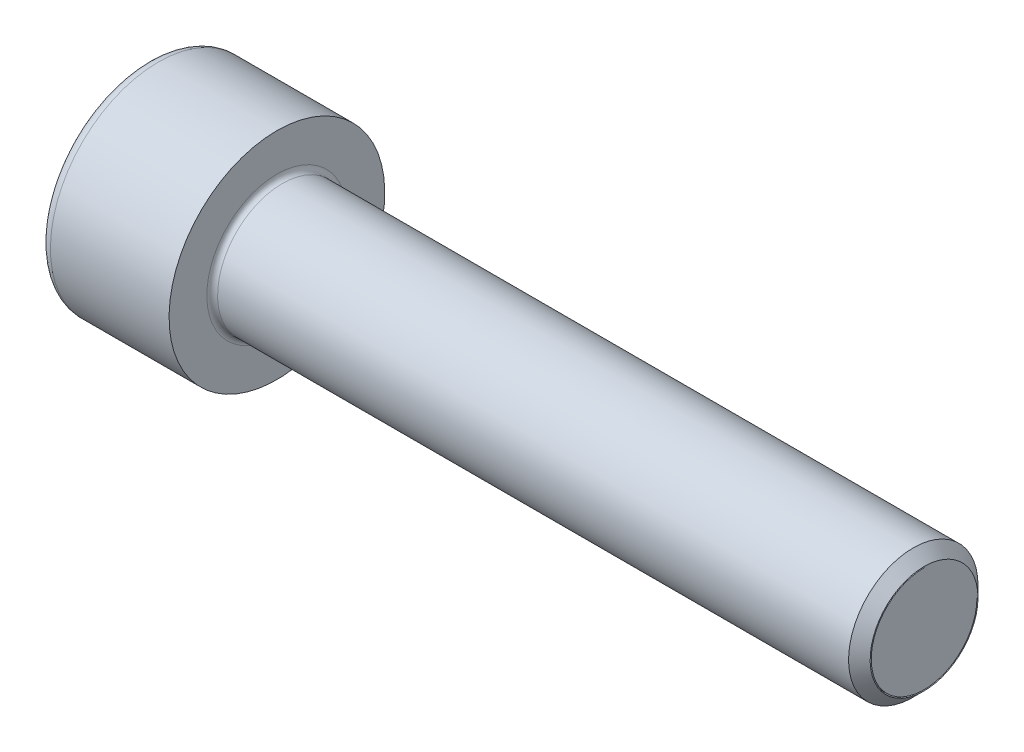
ISO-10303-21;
HEADER;
FILE_DESCRIPTION(('STEP AP214'),'2;1');
FILE_NAME('part.step','',(''),(''),'','','');
FILE_SCHEMA(('AUTOMOTIVE_DESIGN { 1 0 10303 214 1 1 1 1 }'));
ENDSEC;
DATA;
#1=APPLICATION_CONTEXT('core data for automotive mechanical design processes');
#2=APPLICATION_PROTOCOL_DEFINITION('international standard','automotive_design',2000,#1);
#3=PRODUCT_CONTEXT('',#1,'mechanical');
#4=PRODUCT('Part','Part','',(#3));
#5=PRODUCT_RELATED_PRODUCT_CATEGORY('part','',(#4));
#6=PRODUCT_DEFINITION_FORMATION('','',#4);
#7=PRODUCT_DEFINITION_CONTEXT('part definition',#1,'design');
#8=PRODUCT_DEFINITION('design','',#6,#7);
#9=PRODUCT_DEFINITION_SHAPE('','',#8);
#10=(LENGTH_UNIT() NAMED_UNIT(*) SI_UNIT(.MILLI.,.METRE.));
#11=(NAMED_UNIT(*) PLANE_ANGLE_UNIT() SI_UNIT($,.RADIAN.));
#12=(NAMED_UNIT(*) SI_UNIT($,.STERADIAN.) SOLID_ANGLE_UNIT());
#13=UNCERTAINTY_MEASURE_WITH_UNIT(LENGTH_MEASURE(1.E-05),#10,'distance_accuracy_value','');
#14=(GEOMETRIC_REPRESENTATION_CONTEXT(3) GLOBAL_UNCERTAINTY_ASSIGNED_CONTEXT((#13)) GLOBAL_UNIT_ASSIGNED_CONTEXT((#10,
#11,#12)) REPRESENTATION_CONTEXT('',''));
#15=CARTESIAN_POINT('',(0.,0.,0.));
#16=DIRECTION('',(0.,0.,1.));
#17=DIRECTION('',(1.,0.,0.));
#18=AXIS2_PLACEMENT_3D('',#15,#16,#17);
#19=CARTESIAN_POINT('',(3.,1.5,0.));
#20=DIRECTION('',(1.,0.,0.));
#21=DIRECTION('',(0.,0.,-1.));
#22=AXIS2_PLACEMENT_3D('',#19,#20,#21);
#23=PLANE('',#22);
#24=CARTESIAN_POINT('',(3.,0.,0.));
#25=DIRECTION('',(-1.,0.,0.));
#26=DIRECTION('',(0.,1.,0.));
#27=AXIS2_PLACEMENT_3D('',#24,#25,#26);
#28=CIRCLE('',#27,2.45);
#29=CARTESIAN_POINT('',(3.,0.,-2.45000000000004));
#30=VERTEX_POINT('',#29);
#31=CARTESIAN_POINT('',(3.,2.44999999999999,0.));
#32=VERTEX_POINT('',#31);
#33=EDGE_CURVE('E58',#30,#32,#28,.T.);
#34=ORIENTED_EDGE('',*,*,#33,.T.);
#35=DIRECTION('',(0.,1.,0.));
#36=VECTOR('',#35,1.);
#37=CARTESIAN_POINT('',(3.,1.98749999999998,0.));
#38=LINE('',#37,#36);
#39=CARTESIAN_POINT('',(3.,2.49999999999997,0.));
#40=VERTEX_POINT('',#39);
#41=EDGE_CURVE('E303',#32,#40,#38,.T.);
#42=ORIENTED_EDGE('',*,*,#41,.T.);
#43=CARTESIAN_POINT('',(3.,0.,0.));
#44=DIRECTION('',(1.,0.,0.));
#45=DIRECTION('',(0.,1.,0.));
#46=AXIS2_PLACEMENT_3D('',#43,#44,#45);
#47=CIRCLE('',#46,2.5);
#48=CARTESIAN_POINT('',(3.,0.,-2.50000000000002));
#49=VERTEX_POINT('',#48);
#50=EDGE_CURVE('E301',#40,#49,#47,.T.);
#51=ORIENTED_EDGE('',*,*,#50,.T.);
#52=DIRECTION('',(0.,0.,1.));
#53=VECTOR('',#52,1.);
#54=CARTESIAN_POINT('',(3.,0.,-1.23750000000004));
#55=LINE('',#54,#53);
#56=EDGE_CURVE('E168',#49,#30,#55,.T.);
#57=ORIENTED_EDGE('',*,*,#56,.T.);
#58=EDGE_LOOP('',(#34,#42,#51,#57));
#59=FACE_BOUND('',#58,.T.);
#60=ADVANCED_FACE('F40',(#59),#23,.T.);
#61=CARTESIAN_POINT('',(1.62499999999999,0.,0.));
#62=DIRECTION('',(-1.,0.,0.));
#63=DIRECTION('',(0.,0.,1.));
#64=AXIS2_PLACEMENT_3D('',#61,#62,#63);
#65=CYLINDRICAL_SURFACE('',#64,3.);
#66=CARTESIAN_POINT('',(29.5000000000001,0.,0.));
#67=DIRECTION('',(1.,0.,0.));
#68=DIRECTION('',(0.,0.,-1.));
#69=AXIS2_PLACEMENT_3D('',#66,#67,#68);
#70=CIRCLE('',#69,3.);
#71=CARTESIAN_POINT('',(29.5000000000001,0.,-3.00000000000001));
#72=VERTEX_POINT('',#71);
#73=EDGE_CURVE('E11',#72,#72,#70,.F.);
#74=ORIENTED_EDGE('',*,*,#73,.T.);
#75=EDGE_LOOP('',(#74));
#76=FACE_BOUND('',#75,.T.);
#77=CARTESIAN_POINT('',(0.249999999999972,0.,0.));
#78=DIRECTION('',(1.,0.,0.));
#79=DIRECTION('',(0.,1.,0.));
#80=AXIS2_PLACEMENT_3D('',#77,#78,#79);
#81=CIRCLE('',#80,3.);
#82=CARTESIAN_POINT('',(0.249999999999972,3.00000000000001,0.));
#83=VERTEX_POINT('',#82);
#84=EDGE_CURVE('E164',#83,#83,#81,.T.);
#85=ORIENTED_EDGE('',*,*,#84,.T.);
#86=EDGE_LOOP('',(#85));
#87=FACE_BOUND('',#86,.T.);
#88=ADVANCED_FACE('F213',(#76,#87),#65,.T.);
#89=CARTESIAN_POINT('',(0.249999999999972,0.,0.));
#90=DIRECTION('',(1.,0.,0.));
#91=DIRECTION('',(0.,0.,-1.));
#92=AXIS2_PLACEMENT_3D('',#89,#90,#91);
#93=TOROIDAL_SURFACE('',#92,3.25000000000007,0.25);
#94=CARTESIAN_POINT('',(0.,0.,0.));
#95=DIRECTION('',(1.,0.,0.));
#96=DIRECTION('',(0.,1.,0.));
#97=AXIS2_PLACEMENT_3D('',#94,#95,#96);
#98=CIRCLE('',#97,3.25);
#99=CARTESIAN_POINT('',(0.,3.25000000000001,0.));
#100=VERTEX_POINT('',#99);
#101=EDGE_CURVE('E169',#100,#100,#98,.T.);
#102=ORIENTED_EDGE('',*,*,#101,.T.);
#103=EDGE_LOOP('',(#102));
#104=FACE_BOUND('',#103,.T.);
#105=ORIENTED_EDGE('',*,*,#84,.F.);
#106=EDGE_LOOP('',(#105));
#107=FACE_BOUND('',#106,.T.);
#108=ADVANCED_FACE('F208',(#104,#107),#93,.F.);
#109=CARTESIAN_POINT('',(0.,4.12499999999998,0.));
#110=DIRECTION('',(1.,0.,0.));
#111=DIRECTION('',(0.,0.,-1.));
#112=AXIS2_PLACEMENT_3D('',#109,#110,#111);
#113=PLANE('',#112);
#114=CARTESIAN_POINT('',(0.,0.,0.));
#115=DIRECTION('',(1.,0.,0.));
#116=DIRECTION('',(0.,1.,0.));
#117=AXIS2_PLACEMENT_3D('',#114,#115,#116);
#118=CIRCLE('',#117,5.);
#119=CARTESIAN_POINT('',(0.,5.00000000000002,0.));
#120=VERTEX_POINT('',#119);
#121=EDGE_CURVE('E335',#120,#120,#118,.T.);
#122=ORIENTED_EDGE('',*,*,#121,.T.);
#123=EDGE_LOOP('',(#122));
#124=FACE_BOUND('',#123,.T.);
#125=ORIENTED_EDGE('',*,*,#101,.F.);
#126=EDGE_LOOP('',(#125));
#127=FACE_BOUND('',#126,.T.);
#128=ADVANCED_FACE('F212',(#124,#127),#113,.T.);
#129=CARTESIAN_POINT('',(-2.75000000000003,0.,0.));
#130=DIRECTION('',(-1.,0.,0.));
#131=DIRECTION('',(0.,0.,1.));
#132=AXIS2_PLACEMENT_3D('',#129,#130,#131);
#133=CYLINDRICAL_SURFACE('',#132,5.);
#134=CARTESIAN_POINT('',(-5.49999999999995,0.,0.));
#135=DIRECTION('',(1.,0.,0.));
#136=DIRECTION('',(0.,1.,0.));
#137=AXIS2_PLACEMENT_3D('',#134,#135,#136);
#138=CIRCLE('',#137,5.);
#139=CARTESIAN_POINT('',(-5.49999999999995,5.00000000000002,0.));
#140=VERTEX_POINT('',#139);
#141=EDGE_CURVE('E331',#140,#140,#138,.T.);
#142=ORIENTED_EDGE('',*,*,#141,.T.);
#143=EDGE_LOOP('',(#142));
#144=FACE_BOUND('',#143,.T.);
#145=ORIENTED_EDGE('',*,*,#121,.F.);
#146=EDGE_LOOP('',(#145));
#147=FACE_BOUND('',#146,.T.);
#148=ADVANCED_FACE('F218',(#144,#147),#133,.T.);
#149=CARTESIAN_POINT('',(-5.49999999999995,0.,0.));
#150=DIRECTION('',(1.,0.,0.));
#151=DIRECTION('',(0.,0.,-1.));
#152=AXIS2_PLACEMENT_3D('',#149,#150,#151);
#153=TOROIDAL_SURFACE('',#152,4.49999999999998,0.5);
#154=CARTESIAN_POINT('',(-6.00000000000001,0.,0.));
#155=DIRECTION('',(1.,0.,0.));
#156=DIRECTION('',(0.,1.,0.));
#157=AXIS2_PLACEMENT_3D('',#154,#155,#156);
#158=CIRCLE('',#157,4.5);
#159=CARTESIAN_POINT('',(-6.00000000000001,4.50000000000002,0.));
#160=VERTEX_POINT('',#159);
#161=EDGE_CURVE('E159',#160,#160,#158,.T.);
#162=ORIENTED_EDGE('',*,*,#161,.T.);
#163=EDGE_LOOP('',(#162));
#164=FACE_BOUND('',#163,.T.);
#165=ORIENTED_EDGE('',*,*,#141,.F.);
#166=EDGE_LOOP('',(#165));
#167=FACE_BOUND('',#166,.T.);
#168=ADVANCED_FACE('F222',(#164,#167),#153,.T.);
#169=CARTESIAN_POINT('',(-6.00000000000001,2.25,0.));
#170=DIRECTION('',(-1.,0.,0.));
#171=DIRECTION('',(0.,0.,1.));
#172=AXIS2_PLACEMENT_3D('',#169,#170,#171);
#173=PLANE('',#172);
#174=ORIENTED_EDGE('',*,*,#161,.F.);
#175=EDGE_LOOP('',(#174));
#176=FACE_BOUND('',#175,.T.);
#177=DIRECTION('',(0.,-0.500000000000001,-0.866025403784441));
#178=VECTOR('',#177,1.);
#179=CARTESIAN_POINT('',(-6.00000000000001,-1.5229695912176,2.36213928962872));
#180=LINE('',#179,#178);
#181=CARTESIAN_POINT('',(-6.00000000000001,-1.44337567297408,2.5));
#182=VERTEX_POINT('',#181);
#183=CARTESIAN_POINT('',(-6.00000000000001,-2.88675134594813,0.));
#184=VERTEX_POINT('',#183);
#185=EDGE_CURVE('E327',#182,#184,#180,.T.);
#186=ORIENTED_EDGE('',*,*,#185,.T.);
#187=DIRECTION('',(0.,0.500000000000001,-0.866025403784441));
#188=VECTOR('',#187,1.);
#189=CARTESIAN_POINT('',(-6.00000000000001,-2.24465742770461,-1.11213928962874));
#190=LINE('',#189,#188);
#191=CARTESIAN_POINT('',(-6.00000000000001,-1.44337567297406,-2.50000000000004));
#192=VERTEX_POINT('',#191);
#193=EDGE_CURVE('E134',#184,#192,#190,.T.);
#194=ORIENTED_EDGE('',*,*,#193,.T.);
#195=DIRECTION('',(0.,1.,0.));
#196=VECTOR('',#195,1.);
#197=CARTESIAN_POINT('',(-6.00000000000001,0.403312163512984,-2.50000000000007));
#198=LINE('',#197,#196);
#199=CARTESIAN_POINT('',(-6.00000000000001,1.44337567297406,-2.50000000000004));
#200=VERTEX_POINT('',#199);
#201=EDGE_CURVE('E115',#192,#200,#198,.T.);
#202=ORIENTED_EDGE('',*,*,#201,.T.);
#203=DIRECTION('',(0.,0.500000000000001,0.866025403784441));
#204=VECTOR('',#203,1.);
#205=CARTESIAN_POINT('',(-6.00000000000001,2.08546959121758,-1.38786071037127));
#206=LINE('',#205,#204);
#207=CARTESIAN_POINT('',(-6.00000000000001,2.88675134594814,0.));
#208=VERTEX_POINT('',#207);
#209=EDGE_CURVE('E132',#200,#208,#206,.T.);
#210=ORIENTED_EDGE('',*,*,#209,.T.);
#211=DIRECTION('',(0.,-0.500000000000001,0.866025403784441));
#212=VECTOR('',#211,1.);
#213=CARTESIAN_POINT('',(-6.00000000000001,2.80715742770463,0.137860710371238));
#214=LINE('',#213,#212);
#215=CARTESIAN_POINT('',(-6.00000000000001,1.44337567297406,2.49999999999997));
#216=VERTEX_POINT('',#215);
#217=EDGE_CURVE('E142',#208,#216,#214,.T.);
#218=ORIENTED_EDGE('',*,*,#217,.T.);
#219=DIRECTION('',(0.,-1.,0.));
#220=VECTOR('',#219,1.);
#221=CARTESIAN_POINT('',(-6.00000000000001,1.84668783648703,2.49999999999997));
#222=LINE('',#221,#220);
#223=EDGE_CURVE('E147',#216,#182,#222,.T.);
#224=ORIENTED_EDGE('',*,*,#223,.T.);
#225=EDGE_LOOP('',(#186,#194,#202,#210,#218,#224));
#226=FACE_BOUND('',#225,.T.);
#227=ADVANCED_FACE('F130',(#176,#226),#173,.T.);
#228=CARTESIAN_POINT('',(-3.,0.,0.));
#229=DIRECTION('',(-1.,0.,0.));
#230=DIRECTION('',(0.,0.,1.));
#231=AXIS2_PLACEMENT_3D('',#228,#229,#230);
#232=PLANE('',#231);
#233=DIRECTION('',(0.,1.,0.));
#234=VECTOR('',#233,1.);
#235=CARTESIAN_POINT('',(-3.,-1.44337567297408,2.5));
#236=LINE('',#235,#234);
#237=CARTESIAN_POINT('',(-3.,-1.44337567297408,2.5));
#238=VERTEX_POINT('',#237);
#239=CARTESIAN_POINT('',(-3.,1.44337567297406,2.49999999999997));
#240=VERTEX_POINT('',#239);
#241=EDGE_CURVE('E184',#238,#240,#236,.T.);
#242=ORIENTED_EDGE('',*,*,#241,.T.);
#243=DIRECTION('',(0.,0.500000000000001,-0.866025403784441));
#244=VECTOR('',#243,1.);
#245=CARTESIAN_POINT('',(-3.,1.44337567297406,2.49999999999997));
#246=LINE('',#245,#244);
#247=CARTESIAN_POINT('',(-3.,2.88675134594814,0.));
#248=VERTEX_POINT('',#247);
#249=EDGE_CURVE('E188',#240,#248,#246,.T.);
#250=ORIENTED_EDGE('',*,*,#249,.T.);
#251=DIRECTION('',(0.,-0.500000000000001,-0.866025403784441));
#252=VECTOR('',#251,1.);
#253=CARTESIAN_POINT('',(-3.,2.88675134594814,0.));
#254=LINE('',#253,#252);
#255=CARTESIAN_POINT('',(-3.,1.44337567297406,-2.50000000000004));
#256=VERTEX_POINT('',#255);
#257=EDGE_CURVE('E151',#248,#256,#254,.T.);
#258=ORIENTED_EDGE('',*,*,#257,.T.);
#259=DIRECTION('',(0.,-1.,0.));
#260=VECTOR('',#259,1.);
#261=CARTESIAN_POINT('',(-3.,1.44337567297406,-2.50000000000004));
#262=LINE('',#261,#260);
#263=CARTESIAN_POINT('',(-3.,-1.44337567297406,-2.50000000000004));
#264=VERTEX_POINT('',#263);
#265=EDGE_CURVE('E118',#256,#264,#262,.T.);
#266=ORIENTED_EDGE('',*,*,#265,.T.);
#267=DIRECTION('',(0.,-0.500000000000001,0.866025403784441));
#268=VECTOR('',#267,1.);
#269=CARTESIAN_POINT('',(-3.,-1.44337567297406,-2.50000000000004));
#270=LINE('',#269,#268);
#271=CARTESIAN_POINT('',(-3.,-2.88675134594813,0.));
#272=VERTEX_POINT('',#271);
#273=EDGE_CURVE('E192',#264,#272,#270,.T.);
#274=ORIENTED_EDGE('',*,*,#273,.T.);
#275=DIRECTION('',(0.,0.500000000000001,0.866025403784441));
#276=VECTOR('',#275,1.);
#277=CARTESIAN_POINT('',(-3.,-2.88675134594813,0.));
#278=LINE('',#277,#276);
#279=EDGE_CURVE('E124',#272,#238,#278,.T.);
#280=ORIENTED_EDGE('',*,*,#279,.T.);
#281=EDGE_LOOP('',(#242,#250,#258,#266,#274,#280));
#282=FACE_BOUND('',#281,.T.);
#283=ADVANCED_FACE('F229',(#282),#232,.T.);
#284=CARTESIAN_POINT('',(-3.,-1.44337567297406,-2.50000000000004));
#285=DIRECTION('',(0.,0.,1.));
#286=DIRECTION('',(1.,0.,0.));
#287=AXIS2_PLACEMENT_3D('',#284,#285,#286);
#288=PLANE('',#287);
#289=ORIENTED_EDGE('',*,*,#201,.F.);
#290=DIRECTION('',(-1.,0.,0.));
#291=VECTOR('',#290,1.);
#292=CARTESIAN_POINT('',(-3.,-1.44337567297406,-2.50000000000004));
#293=LINE('',#292,#291);
#294=EDGE_CURVE('E125',#264,#192,#293,.T.);
#295=ORIENTED_EDGE('',*,*,#294,.F.);
#296=ORIENTED_EDGE('',*,*,#265,.F.);
#297=DIRECTION('',(-1.,0.,0.));
#298=VECTOR('',#297,1.);
#299=CARTESIAN_POINT('',(-3.,1.44337567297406,-2.50000000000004));
#300=LINE('',#299,#298);
#301=EDGE_CURVE('E112',#256,#200,#300,.T.);
#302=ORIENTED_EDGE('',*,*,#301,.T.);
#303=EDGE_LOOP('',(#289,#295,#296,#302));
#304=FACE_BOUND('',#303,.T.);
#305=ADVANCED_FACE('F114',(#304),#288,.T.);
#306=CARTESIAN_POINT('',(-3.,-2.88675134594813,0.));
#307=DIRECTION('',(0.,0.86602540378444,0.500000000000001));
#308=DIRECTION('',(0.,-0.500000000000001,0.866025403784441));
#309=AXIS2_PLACEMENT_3D('',#306,#307,#308);
#310=PLANE('',#309);
#311=ORIENTED_EDGE('',*,*,#193,.F.);
#312=DIRECTION('',(-1.,0.,0.));
#313=VECTOR('',#312,1.);
#314=CARTESIAN_POINT('',(-3.,-2.88675134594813,0.));
#315=LINE('',#314,#313);
#316=EDGE_CURVE('E173',#272,#184,#315,.T.);
#317=ORIENTED_EDGE('',*,*,#316,.F.);
#318=ORIENTED_EDGE('',*,*,#273,.F.);
#319=ORIENTED_EDGE('',*,*,#294,.T.);
#320=EDGE_LOOP('',(#311,#317,#318,#319));
#321=FACE_BOUND('',#320,.T.);
#322=ADVANCED_FACE('F236',(#321),#310,.T.);
#323=CARTESIAN_POINT('',(-3.,-1.44337567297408,2.5));
#324=DIRECTION('',(0.,0.866025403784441,-0.500000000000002));
#325=DIRECTION('',(0.,0.500000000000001,0.866025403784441));
#326=AXIS2_PLACEMENT_3D('',#323,#324,#325);
#327=PLANE('',#326);
#328=ORIENTED_EDGE('',*,*,#185,.F.);
#329=DIRECTION('',(-1.,0.,0.));
#330=VECTOR('',#329,1.);
#331=CARTESIAN_POINT('',(-3.,-1.44337567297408,2.5));
#332=LINE('',#331,#330);
#333=EDGE_CURVE('E170',#238,#182,#332,.T.);
#334=ORIENTED_EDGE('',*,*,#333,.F.);
#335=ORIENTED_EDGE('',*,*,#279,.F.);
#336=ORIENTED_EDGE('',*,*,#316,.T.);
#337=EDGE_LOOP('',(#328,#334,#335,#336));
#338=FACE_BOUND('',#337,.T.);
#339=ADVANCED_FACE('F239',(#338),#327,.T.);
#340=CARTESIAN_POINT('',(-3.,1.44337567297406,2.49999999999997));
#341=DIRECTION('',(0.,0.,-1.));
#342=DIRECTION('',(-1.,0.,0.));
#343=AXIS2_PLACEMENT_3D('',#340,#341,#342);
#344=PLANE('',#343);
#345=ORIENTED_EDGE('',*,*,#223,.F.);
#346=DIRECTION('',(-1.,0.,0.));
#347=VECTOR('',#346,1.);
#348=CARTESIAN_POINT('',(-3.,1.44337567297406,2.49999999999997));
#349=LINE('',#348,#347);
#350=EDGE_CURVE('E174',#240,#216,#349,.T.);
#351=ORIENTED_EDGE('',*,*,#350,.F.);
#352=ORIENTED_EDGE('',*,*,#241,.F.);
#353=ORIENTED_EDGE('',*,*,#333,.T.);
#354=EDGE_LOOP('',(#345,#351,#352,#353));
#355=FACE_BOUND('',#354,.T.);
#356=ADVANCED_FACE('F243',(#355),#344,.T.);
#357=CARTESIAN_POINT('',(-3.,2.88675134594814,0.));
#358=DIRECTION('',(0.,-0.86602540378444,-0.500000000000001));
#359=DIRECTION('',(0.,0.500000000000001,-0.866025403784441));
#360=AXIS2_PLACEMENT_3D('',#357,#358,#359);
#361=PLANE('',#360);
#362=ORIENTED_EDGE('',*,*,#217,.F.);
#363=DIRECTION('',(-1.,0.,0.));
#364=VECTOR('',#363,1.);
#365=CARTESIAN_POINT('',(-3.,2.88675134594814,0.));
#366=LINE('',#365,#364);
#367=EDGE_CURVE('E139',#248,#208,#366,.T.);
#368=ORIENTED_EDGE('',*,*,#367,.F.);
#369=ORIENTED_EDGE('',*,*,#249,.F.);
#370=ORIENTED_EDGE('',*,*,#350,.T.);
#371=EDGE_LOOP('',(#362,#368,#369,#370));
#372=FACE_BOUND('',#371,.T.);
#373=ADVANCED_FACE('F247',(#372),#361,.T.);
#374=CARTESIAN_POINT('',(-3.,1.44337567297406,-2.50000000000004));
#375=DIRECTION('',(0.,-0.866025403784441,0.500000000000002));
#376=DIRECTION('',(0.,-0.500000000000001,-0.866025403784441));
#377=AXIS2_PLACEMENT_3D('',#374,#375,#376);
#378=PLANE('',#377);
#379=ORIENTED_EDGE('',*,*,#209,.F.);
#380=ORIENTED_EDGE('',*,*,#301,.F.);
#381=ORIENTED_EDGE('',*,*,#257,.F.);
#382=ORIENTED_EDGE('',*,*,#367,.T.);
#383=EDGE_LOOP('',(#379,#380,#381,#382));
#384=FACE_BOUND('',#383,.T.);
#385=ADVANCED_FACE('F138',(#384),#378,.T.);
#386=CARTESIAN_POINT('',(29.9999999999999,0.,0.));
#387=DIRECTION('',(1.,0.,0.));
#388=DIRECTION('',(0.,0.,-1.));
#389=AXIS2_PLACEMENT_3D('',#386,#387,#388);
#390=PLANE('',#389);
#391=DIRECTION('',(0.,0.,-1.));
#392=VECTOR('',#391,1.);
#393=CARTESIAN_POINT('',(29.9999999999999,0.,-1.23750000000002));
#394=LINE('',#393,#392);
#395=CARTESIAN_POINT('',(29.9999999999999,0.,-2.45));
#396=VERTEX_POINT('',#395);
#397=CARTESIAN_POINT('',(29.9999999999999,0.,-2.50000000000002));
#398=VERTEX_POINT('',#397);
#399=EDGE_CURVE('E153',#396,#398,#394,.T.);
#400=ORIENTED_EDGE('',*,*,#399,.T.);
#401=CARTESIAN_POINT('',(29.9999999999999,0.,0.));
#402=DIRECTION('',(1.,0.,0.));
#403=DIRECTION('',(0.,0.,-1.));
#404=AXIS2_PLACEMENT_3D('',#401,#402,#403);
#405=CIRCLE('',#404,2.50000000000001);
#406=CARTESIAN_POINT('',(29.9999999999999,2.50000000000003,0.));
#407=VERTEX_POINT('',#406);
#408=EDGE_CURVE('E50',#398,#407,#405,.T.);
#409=ORIENTED_EDGE('',*,*,#408,.T.);
#410=DIRECTION('',(0.,-1.,0.));
#411=VECTOR('',#410,1.);
#412=CARTESIAN_POINT('',(29.9999999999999,1.23750000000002,0.));
#413=LINE('',#412,#411);
#414=CARTESIAN_POINT('',(29.9999999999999,2.44999999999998,0.));
#415=VERTEX_POINT('',#414);
#416=EDGE_CURVE('E179',#407,#415,#413,.T.);
#417=ORIENTED_EDGE('',*,*,#416,.T.);
#418=CARTESIAN_POINT('',(29.9999999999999,0.,0.));
#419=DIRECTION('',(1.,0.,0.));
#420=DIRECTION('',(0.,1.,0.));
#421=AXIS2_PLACEMENT_3D('',#418,#419,#420);
#422=CIRCLE('',#421,2.45);
#423=EDGE_CURVE('E157',#415,#396,#422,.T.);
#424=ORIENTED_EDGE('',*,*,#423,.T.);
#425=EDGE_LOOP('',(#400,#409,#417,#424));
#426=FACE_BOUND('',#425,.T.);
#427=ADVANCED_FACE('F254',(#426),#390,.T.);
#428=CARTESIAN_POINT('',(16.5,0.,-2.475));
#429=DIRECTION('',(0.,-1.,0.));
#430=DIRECTION('',(0.,0.,-1.));
#431=AXIS2_PLACEMENT_3D('',#428,#429,#430);
#432=PLANE('',#431);
#433=DIRECTION('',(1.,0.,0.));
#434=VECTOR('',#433,1.);
#435=CARTESIAN_POINT('',(29.9999999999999,0.,-2.50000000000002));
#436=LINE('',#435,#434);
#437=EDGE_CURVE('E175',#49,#398,#436,.T.);
#438=ORIENTED_EDGE('',*,*,#437,.T.);
#439=ORIENTED_EDGE('',*,*,#399,.F.);
#440=DIRECTION('',(-1.,0.,0.));
#441=VECTOR('',#440,1.);
#442=CARTESIAN_POINT('',(3.,0.,-2.45000000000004));
#443=LINE('',#442,#441);
#444=EDGE_CURVE('E180',#396,#30,#443,.T.);
#445=ORIENTED_EDGE('',*,*,#444,.T.);
#446=ORIENTED_EDGE('',*,*,#56,.F.);
#447=EDGE_LOOP('',(#438,#439,#445,#446));
#448=FACE_BOUND('',#447,.T.);
#449=ADVANCED_FACE('F257',(#448),#432,.T.);
#450=CARTESIAN_POINT('',(16.5,2.47500000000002,0.));
#451=DIRECTION('',(0.,0.,1.));
#452=DIRECTION('',(1.,0.,0.));
#453=AXIS2_PLACEMENT_3D('',#450,#451,#452);
#454=PLANE('',#453);
#455=ORIENTED_EDGE('',*,*,#41,.F.);
#456=DIRECTION('',(1.,0.,0.));
#457=VECTOR('',#456,1.);
#458=CARTESIAN_POINT('',(3.,2.44999999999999,0.));
#459=LINE('',#458,#457);
#460=EDGE_CURVE('E199',#32,#415,#459,.T.);
#461=ORIENTED_EDGE('',*,*,#460,.T.);
#462=ORIENTED_EDGE('',*,*,#416,.F.);
#463=DIRECTION('',(-1.,0.,0.));
#464=VECTOR('',#463,1.);
#465=CARTESIAN_POINT('',(29.9999999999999,2.50000000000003,0.));
#466=LINE('',#465,#464);
#467=EDGE_CURVE('E163',#407,#40,#466,.T.);
#468=ORIENTED_EDGE('',*,*,#467,.T.);
#469=EDGE_LOOP('',(#455,#461,#462,#468));
#470=FACE_BOUND('',#469,.T.);
#471=ADVANCED_FACE('F261',(#470),#454,.T.);
#472=CARTESIAN_POINT('',(16.5,0.,0.));
#473=DIRECTION('',(-1.,0.,0.));
#474=DIRECTION('',(0.,0.,1.));
#475=AXIS2_PLACEMENT_3D('',#472,#473,#474);
#476=CYLINDRICAL_SURFACE('',#475,2.45);
#477=ORIENTED_EDGE('',*,*,#460,.F.);
#478=ORIENTED_EDGE('',*,*,#33,.F.);
#479=ORIENTED_EDGE('',*,*,#444,.F.);
#480=ORIENTED_EDGE('',*,*,#423,.F.);
#481=EDGE_LOOP('',(#477,#478,#479,#480));
#482=FACE_BOUND('',#481,.T.);
#483=ADVANCED_FACE('F264',(#482),#476,.T.);
#484=CARTESIAN_POINT('',(16.5,0.,0.));
#485=DIRECTION('',(-1.,0.,0.));
#486=DIRECTION('',(0.,0.,1.));
#487=AXIS2_PLACEMENT_3D('',#484,#485,#486);
#488=CYLINDRICAL_SURFACE('',#487,2.5);
#489=ORIENTED_EDGE('',*,*,#50,.F.);
#490=ORIENTED_EDGE('',*,*,#467,.F.);
#491=CARTESIAN_POINT('',(29.9999999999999,0.,0.));
#492=DIRECTION('',(-1.,0.,0.));
#493=DIRECTION('',(0.,1.,0.));
#494=AXIS2_PLACEMENT_3D('',#491,#492,#493);
#495=CIRCLE('',#494,2.5);
#496=EDGE_CURVE('E158',#398,#407,#495,.T.);
#497=ORIENTED_EDGE('',*,*,#496,.F.);
#498=ORIENTED_EDGE('',*,*,#437,.F.);
#499=EDGE_LOOP('',(#489,#490,#497,#498));
#500=FACE_BOUND('',#499,.T.);
#501=ADVANCED_FACE('F42',(#500),#488,.F.);
#502=CARTESIAN_POINT('',(29.9999999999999,0.,0.));
#503=DIRECTION('',(-1.,0.,0.));
#504=DIRECTION('',(0.,0.,1.));
#505=AXIS2_PLACEMENT_3D('',#502,#503,#504);
#506=CONICAL_SURFACE('',#505,2.50000000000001,0.785398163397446);
#507=ORIENTED_EDGE('',*,*,#73,.F.);
#508=EDGE_LOOP('',(#507));
#509=FACE_BOUND('',#508,.T.);
#510=ORIENTED_EDGE('',*,*,#496,.T.);
#511=ORIENTED_EDGE('',*,*,#408,.F.);
#512=EDGE_LOOP('',(#510,#511));
#513=FACE_BOUND('',#512,.T.);
#514=ADVANCED_FACE('F271',(#509,#513),#506,.T.);
#515=CLOSED_SHELL('',(#60,#88,#108,#128,#148,#168,#227,#283,#305,#322,#339,#356,#373,#385,#427,
#449,#471,#483,#501,#514));
#516=MANIFOLD_SOLID_BREP('B2',#515);
#517=ADVANCED_BREP_SHAPE_REPRESENTATION('',(#18,#516),#14);
#518=SHAPE_DEFINITION_REPRESENTATION(#9,#517);
ENDSEC;
END-ISO-10303-21;
